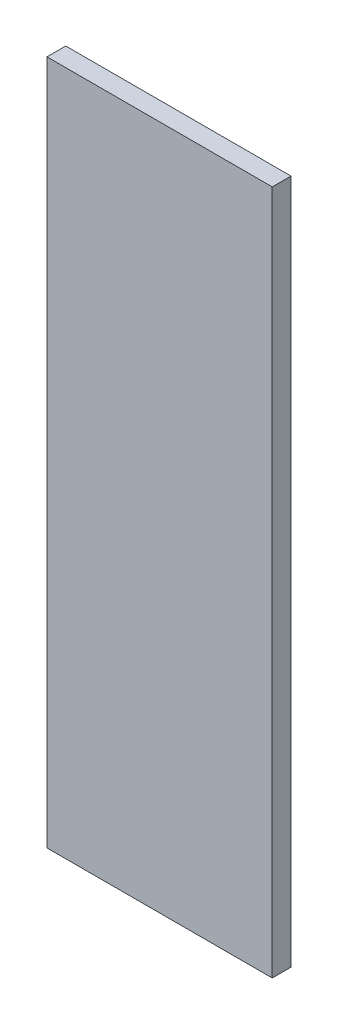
ISO-10303-21;
HEADER;
FILE_DESCRIPTION(('STEP AP214'),'2;1');
FILE_NAME('part.step','',(''),(''),'','','');
FILE_SCHEMA(('AUTOMOTIVE_DESIGN { 1 0 10303 214 1 1 1 1 }'));
ENDSEC;
DATA;
#1=APPLICATION_CONTEXT('core data for automotive mechanical design processes');
#2=APPLICATION_PROTOCOL_DEFINITION('international standard','automotive_design',2000,#1);
#3=PRODUCT_CONTEXT('',#1,'mechanical');
#4=PRODUCT('Part','Part','',(#3));
#5=PRODUCT_RELATED_PRODUCT_CATEGORY('part','',(#4));
#6=PRODUCT_DEFINITION_FORMATION('','',#4);
#7=PRODUCT_DEFINITION_CONTEXT('part definition',#1,'design');
#8=PRODUCT_DEFINITION('design','',#6,#7);
#9=PRODUCT_DEFINITION_SHAPE('','',#8);
#10=(LENGTH_UNIT() NAMED_UNIT(*) SI_UNIT(.MILLI.,.METRE.));
#11=(NAMED_UNIT(*) PLANE_ANGLE_UNIT() SI_UNIT($,.RADIAN.));
#12=(NAMED_UNIT(*) SI_UNIT($,.STERADIAN.) SOLID_ANGLE_UNIT());
#13=UNCERTAINTY_MEASURE_WITH_UNIT(LENGTH_MEASURE(1.E-05),#10,'distance_accuracy_value','');
#14=(GEOMETRIC_REPRESENTATION_CONTEXT(3) GLOBAL_UNCERTAINTY_ASSIGNED_CONTEXT((#13)) GLOBAL_UNIT_ASSIGNED_CONTEXT((#10,
#11,#12)) REPRESENTATION_CONTEXT('',''));
#15=CARTESIAN_POINT('',(0.,0.,0.));
#16=DIRECTION('',(0.,0.,1.));
#17=DIRECTION('',(1.,0.,0.));
#18=AXIS2_PLACEMENT_3D('',#15,#16,#17);
#19=CARTESIAN_POINT('',(-6.,18.25,1.));
#20=DIRECTION('',(1.,0.,0.));
#21=DIRECTION('',(0.,1.,0.));
#22=AXIS2_PLACEMENT_3D('',#19,#20,#21);
#23=PLANE('',#22);
#24=DIRECTION('',(0.,-1.,0.));
#25=VECTOR('',#24,1.);
#26=CARTESIAN_POINT('',(-6.,18.25,0.));
#27=LINE('',#26,#25);
#28=CARTESIAN_POINT('',(-6.,18.25,0.));
#29=VERTEX_POINT('',#28);
#30=CARTESIAN_POINT('',(-6.,-18.25,0.));
#31=VERTEX_POINT('',#30);
#32=EDGE_CURVE('E96',#29,#31,#27,.T.);
#33=ORIENTED_EDGE('',*,*,#32,.T.);
#34=DIRECTION('',(0.,0.,-1.));
#35=VECTOR('',#34,1.);
#36=CARTESIAN_POINT('',(-6.,-18.25,1.));
#37=LINE('',#36,#35);
#38=CARTESIAN_POINT('',(-6.,-18.25,1.));
#39=VERTEX_POINT('',#38);
#40=EDGE_CURVE('E11',#39,#31,#37,.T.);
#41=ORIENTED_EDGE('',*,*,#40,.F.);
#42=DIRECTION('',(0.,-1.,0.));
#43=VECTOR('',#42,1.);
#44=CARTESIAN_POINT('',(-6.,18.25,1.));
#45=LINE('',#44,#43);
#46=CARTESIAN_POINT('',(-6.,18.25,1.));
#47=VERTEX_POINT('',#46);
#48=EDGE_CURVE('E84',#47,#39,#45,.T.);
#49=ORIENTED_EDGE('',*,*,#48,.F.);
#50=DIRECTION('',(0.,0.,-1.));
#51=VECTOR('',#50,1.);
#52=CARTESIAN_POINT('',(-6.,18.25,1.));
#53=LINE('',#52,#51);
#54=EDGE_CURVE('E92',#47,#29,#53,.T.);
#55=ORIENTED_EDGE('',*,*,#54,.T.);
#56=EDGE_LOOP('',(#33,#41,#49,#55));
#57=FACE_BOUND('',#56,.T.);
#58=ADVANCED_FACE('F33',(#57),#23,.F.);
#59=CARTESIAN_POINT('',(-6.,-18.25,1.));
#60=DIRECTION('',(0.,1.,0.));
#61=DIRECTION('',(0.,0.,1.));
#62=AXIS2_PLACEMENT_3D('',#59,#60,#61);
#63=PLANE('',#62);
#64=DIRECTION('',(1.,0.,0.));
#65=VECTOR('',#64,1.);
#66=CARTESIAN_POINT('',(-6.,-18.25,0.));
#67=LINE('',#66,#65);
#68=CARTESIAN_POINT('',(6.,-18.25,0.));
#69=VERTEX_POINT('',#68);
#70=EDGE_CURVE('E88',#31,#69,#67,.T.);
#71=ORIENTED_EDGE('',*,*,#70,.T.);
#72=DIRECTION('',(0.,0.,-1.));
#73=VECTOR('',#72,1.);
#74=CARTESIAN_POINT('',(6.,-18.25,1.));
#75=LINE('',#74,#73);
#76=CARTESIAN_POINT('',(6.,-18.25,1.));
#77=VERTEX_POINT('',#76);
#78=EDGE_CURVE('E41',#77,#69,#75,.T.);
#79=ORIENTED_EDGE('',*,*,#78,.F.);
#80=DIRECTION('',(1.,0.,0.));
#81=VECTOR('',#80,1.);
#82=CARTESIAN_POINT('',(-6.,-18.25,1.));
#83=LINE('',#82,#81);
#84=EDGE_CURVE('E79',#39,#77,#83,.T.);
#85=ORIENTED_EDGE('',*,*,#84,.F.);
#86=ORIENTED_EDGE('',*,*,#40,.T.);
#87=EDGE_LOOP('',(#71,#79,#85,#86));
#88=FACE_BOUND('',#87,.T.);
#89=ADVANCED_FACE('F87',(#88),#63,.F.);
#90=CARTESIAN_POINT('',(6.,18.25,1.));
#91=DIRECTION('',(-1.,0.,0.));
#92=DIRECTION('',(0.,0.,1.));
#93=AXIS2_PLACEMENT_3D('',#90,#91,#92);
#94=PLANE('',#93);
#95=DIRECTION('',(0.,1.,0.));
#96=VECTOR('',#95,1.);
#97=CARTESIAN_POINT('',(6.,18.25,0.));
#98=LINE('',#97,#96);
#99=CARTESIAN_POINT('',(6.,18.25,0.));
#100=VERTEX_POINT('',#99);
#101=EDGE_CURVE('E66',#69,#100,#98,.T.);
#102=ORIENTED_EDGE('',*,*,#101,.T.);
#103=DIRECTION('',(0.,0.,-1.));
#104=VECTOR('',#103,1.);
#105=CARTESIAN_POINT('',(6.,18.25,1.));
#106=LINE('',#105,#104);
#107=CARTESIAN_POINT('',(6.,18.25,1.));
#108=VERTEX_POINT('',#107);
#109=EDGE_CURVE('E89',#108,#100,#106,.T.);
#110=ORIENTED_EDGE('',*,*,#109,.F.);
#111=DIRECTION('',(0.,1.,0.));
#112=VECTOR('',#111,1.);
#113=CARTESIAN_POINT('',(6.,18.25,1.));
#114=LINE('',#113,#112);
#115=EDGE_CURVE('E82',#77,#108,#114,.T.);
#116=ORIENTED_EDGE('',*,*,#115,.F.);
#117=ORIENTED_EDGE('',*,*,#78,.T.);
#118=EDGE_LOOP('',(#102,#110,#116,#117));
#119=FACE_BOUND('',#118,.T.);
#120=ADVANCED_FACE('F90',(#119),#94,.F.);
#121=CARTESIAN_POINT('',(-6.,18.25,1.));
#122=DIRECTION('',(0.,-1.,0.));
#123=DIRECTION('',(0.,0.,-1.));
#124=AXIS2_PLACEMENT_3D('',#121,#122,#123);
#125=PLANE('',#124);
#126=DIRECTION('',(-1.,0.,0.));
#127=VECTOR('',#126,1.);
#128=CARTESIAN_POINT('',(-6.,18.25,0.));
#129=LINE('',#128,#127);
#130=EDGE_CURVE('E72',#100,#29,#129,.T.);
#131=ORIENTED_EDGE('',*,*,#130,.T.);
#132=ORIENTED_EDGE('',*,*,#54,.F.);
#133=DIRECTION('',(-1.,0.,0.));
#134=VECTOR('',#133,1.);
#135=CARTESIAN_POINT('',(-6.,18.25,1.));
#136=LINE('',#135,#134);
#137=EDGE_CURVE('E49',#108,#47,#136,.T.);
#138=ORIENTED_EDGE('',*,*,#137,.F.);
#139=ORIENTED_EDGE('',*,*,#109,.T.);
#140=EDGE_LOOP('',(#131,#132,#138,#139));
#141=FACE_BOUND('',#140,.T.);
#142=ADVANCED_FACE('F103',(#141),#125,.F.);
#143=CARTESIAN_POINT('',(0.,0.,1.));
#144=DIRECTION('',(0.,0.,1.));
#145=DIRECTION('',(1.,0.,0.));
#146=AXIS2_PLACEMENT_3D('',#143,#144,#145);
#147=PLANE('',#146);
#148=ORIENTED_EDGE('',*,*,#48,.T.);
#149=ORIENTED_EDGE('',*,*,#84,.T.);
#150=ORIENTED_EDGE('',*,*,#115,.T.);
#151=ORIENTED_EDGE('',*,*,#137,.T.);
#152=EDGE_LOOP('',(#148,#149,#150,#151));
#153=FACE_BOUND('',#152,.T.);
#154=ADVANCED_FACE('F80',(#153),#147,.T.);
#155=CARTESIAN_POINT('',(0.,0.,0.));
#156=DIRECTION('',(0.,0.,1.));
#157=DIRECTION('',(1.,0.,0.));
#158=AXIS2_PLACEMENT_3D('',#155,#156,#157);
#159=PLANE('',#158);
#160=ORIENTED_EDGE('',*,*,#32,.F.);
#161=ORIENTED_EDGE('',*,*,#130,.F.);
#162=ORIENTED_EDGE('',*,*,#101,.F.);
#163=ORIENTED_EDGE('',*,*,#70,.F.);
#164=EDGE_LOOP('',(#160,#161,#162,#163));
#165=FACE_BOUND('',#164,.T.);
#166=ADVANCED_FACE('F106',(#165),#159,.F.);
#167=CLOSED_SHELL('',(#58,#89,#120,#142,#154,#166));
#168=MANIFOLD_SOLID_BREP('B2',#167);
#169=ADVANCED_BREP_SHAPE_REPRESENTATION('',(#18,#168),#14);
#170=SHAPE_DEFINITION_REPRESENTATION(#9,#169);
ENDSEC;
END-ISO-10303-21;
